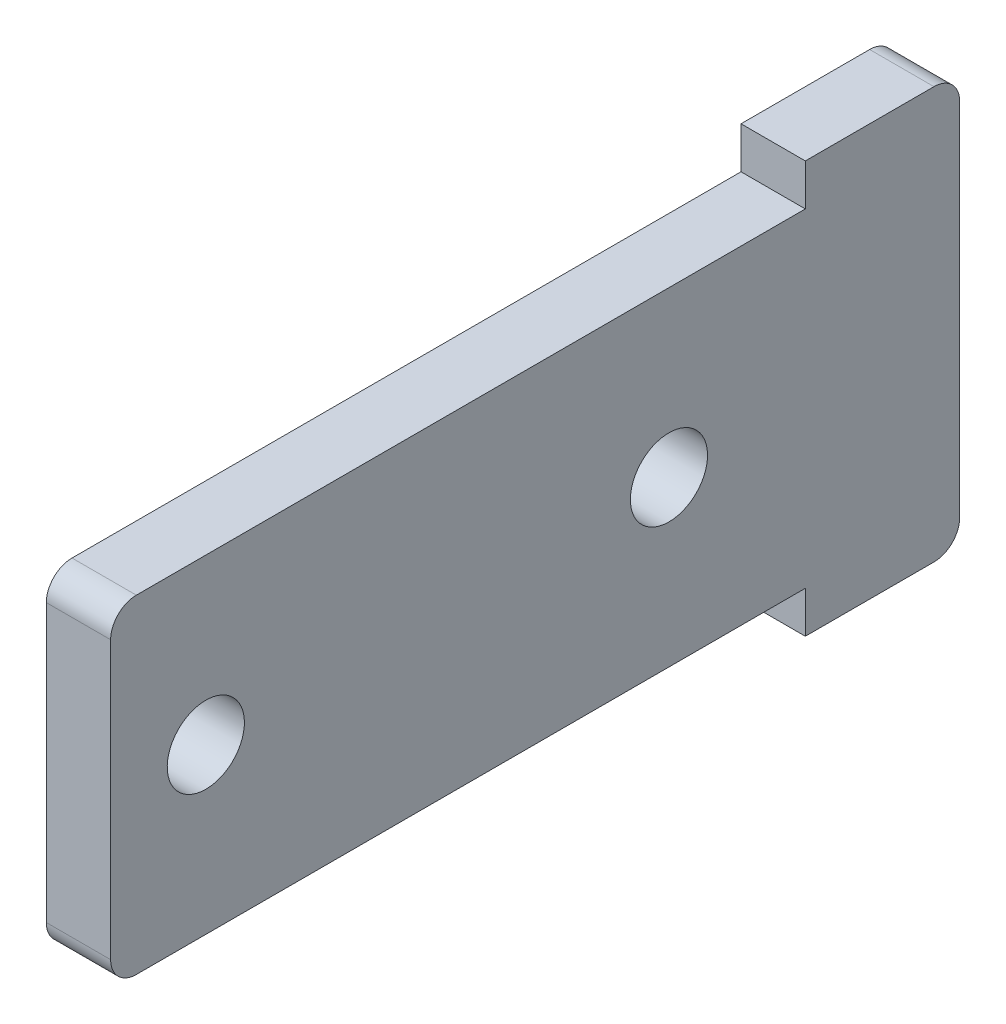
ISO-10303-21;
HEADER;
FILE_DESCRIPTION(('STEP AP214'),'2;1');
FILE_NAME('part.step','',(''),(''),'','','');
FILE_SCHEMA(('AUTOMOTIVE_DESIGN { 1 0 10303 214 1 1 1 1 }'));
ENDSEC;
DATA;
#1=APPLICATION_CONTEXT('core data for automotive mechanical design processes');
#2=APPLICATION_PROTOCOL_DEFINITION('international standard','automotive_design',2000,#1);
#3=PRODUCT_CONTEXT('',#1,'mechanical');
#4=PRODUCT('Part','Part','',(#3));
#5=PRODUCT_RELATED_PRODUCT_CATEGORY('part','',(#4));
#6=PRODUCT_DEFINITION_FORMATION('','',#4);
#7=PRODUCT_DEFINITION_CONTEXT('part definition',#1,'design');
#8=PRODUCT_DEFINITION('design','',#6,#7);
#9=PRODUCT_DEFINITION_SHAPE('','',#8);
#10=(LENGTH_UNIT() NAMED_UNIT(*) SI_UNIT(.MILLI.,.METRE.));
#11=(NAMED_UNIT(*) PLANE_ANGLE_UNIT() SI_UNIT($,.RADIAN.));
#12=(NAMED_UNIT(*) SI_UNIT($,.STERADIAN.) SOLID_ANGLE_UNIT());
#13=UNCERTAINTY_MEASURE_WITH_UNIT(LENGTH_MEASURE(1.E-05),#10,'distance_accuracy_value','');
#14=(GEOMETRIC_REPRESENTATION_CONTEXT(3) GLOBAL_UNCERTAINTY_ASSIGNED_CONTEXT((#13)) GLOBAL_UNIT_ASSIGNED_CONTEXT((#10,
#11,#12)) REPRESENTATION_CONTEXT('',''));
#15=CARTESIAN_POINT('',(0.,0.,0.));
#16=DIRECTION('',(0.,0.,1.));
#17=DIRECTION('',(1.,0.,0.));
#18=AXIS2_PLACEMENT_3D('',#15,#16,#17);
#19=CARTESIAN_POINT('',(-139.654437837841,-38.0629308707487,10.5));
#20=DIRECTION('',(1.,0.,0.));
#21=DIRECTION('',(0.,1.,0.));
#22=AXIS2_PLACEMENT_3D('',#19,#20,#21);
#23=PLANE('',#22);
#24=CARTESIAN_POINT('',(-139.654437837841,-38.0629740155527,23.3));
#25=DIRECTION('',(1.,0.,0.));
#26=DIRECTION('',(0.,1.,0.));
#27=AXIS2_PLACEMENT_3D('',#24,#25,#26);
#28=CIRCLE('',#27,1.5);
#29=CARTESIAN_POINT('',(-139.654437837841,-39.5629740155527,23.3));
#30=VERTEX_POINT('',#29);
#31=EDGE_CURVE('E207',#30,#30,#28,.T.);
#32=ORIENTED_EDGE('',*,*,#31,.T.);
#33=EDGE_LOOP('',(#32));
#34=FACE_BOUND('',#33,.T.);
#35=CARTESIAN_POINT('',(-139.654437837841,-38.0629740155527,5.3));
#36=DIRECTION('',(1.,0.,0.));
#37=DIRECTION('',(0.,1.,0.));
#38=AXIS2_PLACEMENT_3D('',#35,#36,#37);
#39=CIRCLE('',#38,1.5);
#40=CARTESIAN_POINT('',(-139.654437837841,-39.5629740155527,5.3));
#41=VERTEX_POINT('',#40);
#42=EDGE_CURVE('E199',#41,#41,#39,.T.);
#43=ORIENTED_EDGE('',*,*,#42,.T.);
#44=EDGE_LOOP('',(#43));
#45=FACE_BOUND('',#44,.T.);
#46=CARTESIAN_POINT('',(-139.654437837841,-45.0629308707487,-5.));
#47=DIRECTION('',(-1.,0.,0.));
#48=DIRECTION('',(0.,-1.,0.));
#49=AXIS2_PLACEMENT_3D('',#46,#47,#48);
#50=CIRCLE('',#49,1.);
#51=CARTESIAN_POINT('',(-139.654437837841,-45.0629308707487,-6.));
#52=VERTEX_POINT('',#51);
#53=CARTESIAN_POINT('',(-139.654437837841,-46.0629308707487,-5.));
#54=VERTEX_POINT('',#53);
#55=EDGE_CURVE('E11',#52,#54,#50,.T.);
#56=ORIENTED_EDGE('',*,*,#55,.T.);
#57=DIRECTION('',(0.,0.,1.));
#58=VECTOR('',#57,1.);
#59=CARTESIAN_POINT('',(-139.654437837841,-46.0629308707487,-5.));
#60=LINE('',#59,#58);
#61=CARTESIAN_POINT('',(-139.654437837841,-46.0629308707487,0.));
#62=VERTEX_POINT('',#61);
#63=EDGE_CURVE('E171',#54,#62,#60,.T.);
#64=ORIENTED_EDGE('',*,*,#63,.T.);
#65=DIRECTION('',(0.,1.,0.));
#66=VECTOR('',#65,1.);
#67=CARTESIAN_POINT('',(-139.654437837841,-46.0629308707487,0.));
#68=LINE('',#67,#66);
#69=CARTESIAN_POINT('',(-139.654437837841,-44.4468944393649,0.));
#70=VERTEX_POINT('',#69);
#71=EDGE_CURVE('E123',#62,#70,#68,.T.);
#72=ORIENTED_EDGE('',*,*,#71,.T.);
#73=DIRECTION('',(0.,0.,1.));
#74=VECTOR('',#73,1.);
#75=CARTESIAN_POINT('',(-139.654437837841,-44.4468944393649,26.));
#76=LINE('',#75,#74);
#77=CARTESIAN_POINT('',(-139.654437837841,-44.4468944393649,26.));
#78=VERTEX_POINT('',#77);
#79=EDGE_CURVE('E227',#70,#78,#76,.T.);
#80=ORIENTED_EDGE('',*,*,#79,.T.);
#81=CARTESIAN_POINT('',(-139.654437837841,-43.4468944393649,26.));
#82=DIRECTION('',(-1.,0.,0.));
#83=DIRECTION('',(0.,0.,1.));
#84=AXIS2_PLACEMENT_3D('',#81,#82,#83);
#85=CIRCLE('',#84,1.);
#86=CARTESIAN_POINT('',(-139.654437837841,-43.4468944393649,27.));
#87=VERTEX_POINT('',#86);
#88=EDGE_CURVE('E253',#78,#87,#85,.T.);
#89=ORIENTED_EDGE('',*,*,#88,.T.);
#90=DIRECTION('',(0.,1.,0.));
#91=VECTOR('',#90,1.);
#92=CARTESIAN_POINT('',(-139.654437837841,-32.6789673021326,27.));
#93=LINE('',#92,#91);
#94=CARTESIAN_POINT('',(-139.654437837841,-32.6789673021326,27.));
#95=VERTEX_POINT('',#94);
#96=EDGE_CURVE('E219',#87,#95,#93,.T.);
#97=ORIENTED_EDGE('',*,*,#96,.T.);
#98=CARTESIAN_POINT('',(-139.654437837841,-32.6789673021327,26.));
#99=DIRECTION('',(-1.,0.,0.));
#100=DIRECTION('',(0.,1.,0.));
#101=AXIS2_PLACEMENT_3D('',#98,#99,#100);
#102=CIRCLE('',#101,1.);
#103=CARTESIAN_POINT('',(-139.654437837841,-31.6789673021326,26.));
#104=VERTEX_POINT('',#103);
#105=EDGE_CURVE('E153',#95,#104,#102,.T.);
#106=ORIENTED_EDGE('',*,*,#105,.T.);
#107=DIRECTION('',(0.,0.,-1.));
#108=VECTOR('',#107,1.);
#109=CARTESIAN_POINT('',(-139.654437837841,-31.6789673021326,0.));
#110=LINE('',#109,#108);
#111=CARTESIAN_POINT('',(-139.654437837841,-31.6789673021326,0.));
#112=VERTEX_POINT('',#111);
#113=EDGE_CURVE('E231',#104,#112,#110,.T.);
#114=ORIENTED_EDGE('',*,*,#113,.T.);
#115=DIRECTION('',(0.,1.,0.));
#116=VECTOR('',#115,1.);
#117=CARTESIAN_POINT('',(-139.654437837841,-46.0629308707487,0.));
#118=LINE('',#117,#116);
#119=CARTESIAN_POINT('',(-139.654437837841,-30.0629308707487,0.));
#120=VERTEX_POINT('',#119);
#121=EDGE_CURVE('E282',#112,#120,#118,.T.);
#122=ORIENTED_EDGE('',*,*,#121,.T.);
#123=DIRECTION('',(0.,0.,-1.));
#124=VECTOR('',#123,1.);
#125=CARTESIAN_POINT('',(-139.654437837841,-30.0629308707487,0.));
#126=LINE('',#125,#124);
#127=CARTESIAN_POINT('',(-139.654437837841,-30.0629308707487,-5.));
#128=VERTEX_POINT('',#127);
#129=EDGE_CURVE('E93',#120,#128,#126,.T.);
#130=ORIENTED_EDGE('',*,*,#129,.T.);
#131=CARTESIAN_POINT('',(-139.654437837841,-31.0629308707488,-5.));
#132=DIRECTION('',(-1.,0.,0.));
#133=DIRECTION('',(0.,0.,-1.));
#134=AXIS2_PLACEMENT_3D('',#131,#132,#133);
#135=CIRCLE('',#134,1.);
#136=CARTESIAN_POINT('',(-139.654437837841,-31.0629308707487,-6.));
#137=VERTEX_POINT('',#136);
#138=EDGE_CURVE('E218',#128,#137,#135,.T.);
#139=ORIENTED_EDGE('',*,*,#138,.T.);
#140=DIRECTION('',(0.,-1.,0.));
#141=VECTOR('',#140,1.);
#142=CARTESIAN_POINT('',(-139.654437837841,-31.0629308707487,-6.));
#143=LINE('',#142,#141);
#144=EDGE_CURVE('E213',#137,#52,#143,.T.);
#145=ORIENTED_EDGE('',*,*,#144,.T.);
#146=EDGE_LOOP('',(#56,#64,#72,#80,#89,#97,#106,#114,#122,#130,#139,#145));
#147=FACE_BOUND('',#146,.T.);
#148=ADVANCED_FACE('F16',(#34,#45,#147),#23,.F.);
#149=CARTESIAN_POINT('',(-137.154437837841,-38.0629308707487,10.5));
#150=DIRECTION('',(1.,0.,0.));
#151=DIRECTION('',(0.,1.,0.));
#152=AXIS2_PLACEMENT_3D('',#149,#150,#151);
#153=PLANE('',#152);
#154=CARTESIAN_POINT('',(-137.154437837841,-38.0629740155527,23.3));
#155=DIRECTION('',(-1.,0.,0.));
#156=DIRECTION('',(0.,1.,0.));
#157=AXIS2_PLACEMENT_3D('',#154,#155,#156);
#158=CIRCLE('',#157,1.5);
#159=CARTESIAN_POINT('',(-137.154437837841,-39.5629740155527,23.3));
#160=VERTEX_POINT('',#159);
#161=EDGE_CURVE('E204',#160,#160,#158,.T.);
#162=ORIENTED_EDGE('',*,*,#161,.T.);
#163=EDGE_LOOP('',(#162));
#164=FACE_BOUND('',#163,.T.);
#165=CARTESIAN_POINT('',(-137.154437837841,-38.0629740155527,5.3));
#166=DIRECTION('',(-1.,0.,0.));
#167=DIRECTION('',(0.,1.,0.));
#168=AXIS2_PLACEMENT_3D('',#165,#166,#167);
#169=CIRCLE('',#168,1.5);
#170=CARTESIAN_POINT('',(-137.154437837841,-39.5629740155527,5.3));
#171=VERTEX_POINT('',#170);
#172=EDGE_CURVE('E203',#171,#171,#169,.T.);
#173=ORIENTED_EDGE('',*,*,#172,.T.);
#174=EDGE_LOOP('',(#173));
#175=FACE_BOUND('',#174,.T.);
#176=CARTESIAN_POINT('',(-137.154437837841,-45.0629308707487,-5.));
#177=DIRECTION('',(1.,0.,0.));
#178=DIRECTION('',(0.,-1.,0.));
#179=AXIS2_PLACEMENT_3D('',#176,#177,#178);
#180=CIRCLE('',#179,1.);
#181=CARTESIAN_POINT('',(-137.154437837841,-46.0629308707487,-5.));
#182=VERTEX_POINT('',#181);
#183=CARTESIAN_POINT('',(-137.154437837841,-45.0629308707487,-6.));
#184=VERTEX_POINT('',#183);
#185=EDGE_CURVE('E27',#182,#184,#180,.T.);
#186=ORIENTED_EDGE('',*,*,#185,.T.);
#187=DIRECTION('',(0.,-1.,0.));
#188=VECTOR('',#187,1.);
#189=CARTESIAN_POINT('',(-137.154437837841,-31.0629308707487,-6.));
#190=LINE('',#189,#188);
#191=CARTESIAN_POINT('',(-137.154437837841,-31.0629308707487,-6.));
#192=VERTEX_POINT('',#191);
#193=EDGE_CURVE('E202',#192,#184,#190,.T.);
#194=ORIENTED_EDGE('',*,*,#193,.F.);
#195=CARTESIAN_POINT('',(-137.154437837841,-31.0629308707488,-5.));
#196=DIRECTION('',(1.,0.,0.));
#197=DIRECTION('',(0.,0.,-1.));
#198=AXIS2_PLACEMENT_3D('',#195,#196,#197);
#199=CIRCLE('',#198,1.);
#200=CARTESIAN_POINT('',(-137.154437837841,-30.0629308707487,-5.));
#201=VERTEX_POINT('',#200);
#202=EDGE_CURVE('E212',#192,#201,#199,.T.);
#203=ORIENTED_EDGE('',*,*,#202,.T.);
#204=DIRECTION('',(0.,0.,-1.));
#205=VECTOR('',#204,1.);
#206=CARTESIAN_POINT('',(-137.154437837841,-30.0629308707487,0.));
#207=LINE('',#206,#205);
#208=CARTESIAN_POINT('',(-137.154437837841,-30.0629308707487,0.));
#209=VERTEX_POINT('',#208);
#210=EDGE_CURVE('E217',#209,#201,#207,.T.);
#211=ORIENTED_EDGE('',*,*,#210,.F.);
#212=DIRECTION('',(0.,1.,0.));
#213=VECTOR('',#212,1.);
#214=CARTESIAN_POINT('',(-137.154437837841,-46.0629308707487,0.));
#215=LINE('',#214,#213);
#216=CARTESIAN_POINT('',(-137.154437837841,-31.6789673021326,0.));
#217=VERTEX_POINT('',#216);
#218=EDGE_CURVE('E80',#217,#209,#215,.T.);
#219=ORIENTED_EDGE('',*,*,#218,.F.);
#220=DIRECTION('',(0.,0.,1.));
#221=VECTOR('',#220,1.);
#222=CARTESIAN_POINT('',(-137.154437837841,-31.6789673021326,0.));
#223=LINE('',#222,#221);
#224=CARTESIAN_POINT('',(-137.154437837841,-31.6789673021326,26.));
#225=VERTEX_POINT('',#224);
#226=EDGE_CURVE('E270',#217,#225,#223,.T.);
#227=ORIENTED_EDGE('',*,*,#226,.T.);
#228=CARTESIAN_POINT('',(-137.154437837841,-32.6789673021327,26.));
#229=DIRECTION('',(1.,0.,0.));
#230=DIRECTION('',(0.,1.,0.));
#231=AXIS2_PLACEMENT_3D('',#228,#229,#230);
#232=CIRCLE('',#231,1.);
#233=CARTESIAN_POINT('',(-137.154437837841,-32.6789673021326,27.));
#234=VERTEX_POINT('',#233);
#235=EDGE_CURVE('E164',#225,#234,#232,.T.);
#236=ORIENTED_EDGE('',*,*,#235,.T.);
#237=DIRECTION('',(0.,-1.,0.));
#238=VECTOR('',#237,1.);
#239=CARTESIAN_POINT('',(-137.154437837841,-32.6789673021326,27.));
#240=LINE('',#239,#238);
#241=CARTESIAN_POINT('',(-137.154437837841,-43.4468944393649,27.));
#242=VERTEX_POINT('',#241);
#243=EDGE_CURVE('E196',#234,#242,#240,.T.);
#244=ORIENTED_EDGE('',*,*,#243,.T.);
#245=CARTESIAN_POINT('',(-137.154437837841,-43.4468944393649,26.));
#246=DIRECTION('',(1.,0.,0.));
#247=DIRECTION('',(0.,0.,1.));
#248=AXIS2_PLACEMENT_3D('',#245,#246,#247);
#249=CIRCLE('',#248,1.);
#250=CARTESIAN_POINT('',(-137.154437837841,-44.4468944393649,26.));
#251=VERTEX_POINT('',#250);
#252=EDGE_CURVE('E291',#242,#251,#249,.T.);
#253=ORIENTED_EDGE('',*,*,#252,.T.);
#254=DIRECTION('',(0.,0.,-1.));
#255=VECTOR('',#254,1.);
#256=CARTESIAN_POINT('',(-137.154437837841,-44.4468944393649,26.));
#257=LINE('',#256,#255);
#258=CARTESIAN_POINT('',(-137.154437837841,-44.4468944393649,0.));
#259=VERTEX_POINT('',#258);
#260=EDGE_CURVE('E223',#251,#259,#257,.T.);
#261=ORIENTED_EDGE('',*,*,#260,.T.);
#262=DIRECTION('',(0.,1.,0.));
#263=VECTOR('',#262,1.);
#264=CARTESIAN_POINT('',(-137.154437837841,-46.0629308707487,0.));
#265=LINE('',#264,#263);
#266=CARTESIAN_POINT('',(-137.154437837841,-46.0629308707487,0.));
#267=VERTEX_POINT('',#266);
#268=EDGE_CURVE('E138',#267,#259,#265,.T.);
#269=ORIENTED_EDGE('',*,*,#268,.F.);
#270=DIRECTION('',(0.,0.,1.));
#271=VECTOR('',#270,1.);
#272=CARTESIAN_POINT('',(-137.154437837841,-46.0629308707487,-5.));
#273=LINE('',#272,#271);
#274=EDGE_CURVE('E177',#182,#267,#273,.T.);
#275=ORIENTED_EDGE('',*,*,#274,.F.);
#276=EDGE_LOOP('',(#186,#194,#203,#211,#219,#227,#236,#244,#253,#261,#269,#275));
#277=FACE_BOUND('',#276,.T.);
#278=ADVANCED_FACE('F322',(#164,#175,#277),#153,.T.);
#279=CARTESIAN_POINT('',(-137.154437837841,-45.0629308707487,-5.));
#280=DIRECTION('',(-1.,0.,0.));
#281=DIRECTION('',(0.,-1.,0.));
#282=AXIS2_PLACEMENT_3D('',#279,#280,#281);
#283=CYLINDRICAL_SURFACE('',#282,1.);
#284=ORIENTED_EDGE('',*,*,#185,.F.);
#285=DIRECTION('',(-1.,0.,0.));
#286=VECTOR('',#285,1.);
#287=CARTESIAN_POINT('',(-137.154437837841,-46.0629308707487,-5.));
#288=LINE('',#287,#286);
#289=EDGE_CURVE('E176',#182,#54,#288,.T.);
#290=ORIENTED_EDGE('',*,*,#289,.T.);
#291=ORIENTED_EDGE('',*,*,#55,.F.);
#292=DIRECTION('',(-1.,0.,0.));
#293=VECTOR('',#292,1.);
#294=CARTESIAN_POINT('',(-137.154437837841,-45.0629308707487,-6.));
#295=LINE('',#294,#293);
#296=EDGE_CURVE('E238',#184,#52,#295,.T.);
#297=ORIENTED_EDGE('',*,*,#296,.F.);
#298=EDGE_LOOP('',(#284,#290,#291,#297));
#299=FACE_BOUND('',#298,.T.);
#300=ADVANCED_FACE('F324',(#299),#283,.T.);
#301=CARTESIAN_POINT('',(-137.154437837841,-46.0629308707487,-5.));
#302=DIRECTION('',(0.,-1.,0.));
#303=DIRECTION('',(0.,0.,-1.));
#304=AXIS2_PLACEMENT_3D('',#301,#302,#303);
#305=PLANE('',#304);
#306=ORIENTED_EDGE('',*,*,#274,.T.);
#307=DIRECTION('',(-1.,0.,0.));
#308=VECTOR('',#307,1.);
#309=CARTESIAN_POINT('',(-137.154437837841,-46.0629308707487,0.));
#310=LINE('',#309,#308);
#311=EDGE_CURVE('E179',#267,#62,#310,.T.);
#312=ORIENTED_EDGE('',*,*,#311,.T.);
#313=ORIENTED_EDGE('',*,*,#63,.F.);
#314=ORIENTED_EDGE('',*,*,#289,.F.);
#315=EDGE_LOOP('',(#306,#312,#313,#314));
#316=FACE_BOUND('',#315,.T.);
#317=ADVANCED_FACE('F180',(#316),#305,.T.);
#318=CARTESIAN_POINT('',(-137.154437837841,-46.0629308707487,0.));
#319=DIRECTION('',(0.,0.,1.));
#320=DIRECTION('',(1.,0.,0.));
#321=AXIS2_PLACEMENT_3D('',#318,#319,#320);
#322=PLANE('',#321);
#323=ORIENTED_EDGE('',*,*,#268,.T.);
#324=DIRECTION('',(-1.,0.,0.));
#325=VECTOR('',#324,1.);
#326=CARTESIAN_POINT('',(-137.154437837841,-44.4468944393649,0.));
#327=LINE('',#326,#325);
#328=EDGE_CURVE('E185',#259,#70,#327,.T.);
#329=ORIENTED_EDGE('',*,*,#328,.T.);
#330=ORIENTED_EDGE('',*,*,#71,.F.);
#331=ORIENTED_EDGE('',*,*,#311,.F.);
#332=EDGE_LOOP('',(#323,#329,#330,#331));
#333=FACE_BOUND('',#332,.T.);
#334=ADVANCED_FACE('F184',(#333),#322,.T.);
#335=CARTESIAN_POINT('',(-137.154437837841,-44.4468944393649,0.));
#336=DIRECTION('',(0.,-1.,0.));
#337=DIRECTION('',(0.,0.,-1.));
#338=AXIS2_PLACEMENT_3D('',#335,#336,#337);
#339=PLANE('',#338);
#340=ORIENTED_EDGE('',*,*,#260,.F.);
#341=DIRECTION('',(-1.,0.,0.));
#342=VECTOR('',#341,1.);
#343=CARTESIAN_POINT('',(-137.154437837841,-44.4468944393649,26.));
#344=LINE('',#343,#342);
#345=EDGE_CURVE('E228',#251,#78,#344,.T.);
#346=ORIENTED_EDGE('',*,*,#345,.T.);
#347=ORIENTED_EDGE('',*,*,#79,.F.);
#348=ORIENTED_EDGE('',*,*,#328,.F.);
#349=EDGE_LOOP('',(#340,#346,#347,#348));
#350=FACE_BOUND('',#349,.T.);
#351=ADVANCED_FACE('F361',(#350),#339,.T.);
#352=CARTESIAN_POINT('',(-137.154437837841,-43.4468944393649,26.));
#353=DIRECTION('',(-1.,0.,0.));
#354=DIRECTION('',(0.,0.,1.));
#355=AXIS2_PLACEMENT_3D('',#352,#353,#354);
#356=CYLINDRICAL_SURFACE('',#355,1.);
#357=ORIENTED_EDGE('',*,*,#252,.F.);
#358=DIRECTION('',(-1.,0.,0.));
#359=VECTOR('',#358,1.);
#360=CARTESIAN_POINT('',(-137.154437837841,-43.4468944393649,27.));
#361=LINE('',#360,#359);
#362=EDGE_CURVE('E222',#242,#87,#361,.T.);
#363=ORIENTED_EDGE('',*,*,#362,.T.);
#364=ORIENTED_EDGE('',*,*,#88,.F.);
#365=ORIENTED_EDGE('',*,*,#345,.F.);
#366=EDGE_LOOP('',(#357,#363,#364,#365));
#367=FACE_BOUND('',#366,.T.);
#368=ADVANCED_FACE('F349',(#367),#356,.T.);
#369=CARTESIAN_POINT('',(-137.154437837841,-43.4468944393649,27.));
#370=DIRECTION('',(0.,0.,1.));
#371=DIRECTION('',(1.,0.,0.));
#372=AXIS2_PLACEMENT_3D('',#369,#370,#371);
#373=PLANE('',#372);
#374=ORIENTED_EDGE('',*,*,#243,.F.);
#375=DIRECTION('',(-1.,0.,0.));
#376=VECTOR('',#375,1.);
#377=CARTESIAN_POINT('',(-137.154437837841,-32.6789673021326,27.));
#378=LINE('',#377,#376);
#379=EDGE_CURVE('E292',#234,#95,#378,.T.);
#380=ORIENTED_EDGE('',*,*,#379,.T.);
#381=ORIENTED_EDGE('',*,*,#96,.F.);
#382=ORIENTED_EDGE('',*,*,#362,.F.);
#383=EDGE_LOOP('',(#374,#380,#381,#382));
#384=FACE_BOUND('',#383,.T.);
#385=ADVANCED_FACE('F350',(#384),#373,.T.);
#386=CARTESIAN_POINT('',(-137.154437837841,-32.6789673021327,26.));
#387=DIRECTION('',(-1.,0.,0.));
#388=DIRECTION('',(0.,1.,0.));
#389=AXIS2_PLACEMENT_3D('',#386,#387,#388);
#390=CYLINDRICAL_SURFACE('',#389,1.);
#391=ORIENTED_EDGE('',*,*,#235,.F.);
#392=DIRECTION('',(-1.,0.,0.));
#393=VECTOR('',#392,1.);
#394=CARTESIAN_POINT('',(-137.154437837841,-31.6789673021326,26.));
#395=LINE('',#394,#393);
#396=EDGE_CURVE('E198',#225,#104,#395,.T.);
#397=ORIENTED_EDGE('',*,*,#396,.T.);
#398=ORIENTED_EDGE('',*,*,#105,.F.);
#399=ORIENTED_EDGE('',*,*,#379,.F.);
#400=EDGE_LOOP('',(#391,#397,#398,#399));
#401=FACE_BOUND('',#400,.T.);
#402=ADVANCED_FACE('F352',(#401),#390,.T.);
#403=CARTESIAN_POINT('',(-137.154437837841,-31.6789673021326,26.));
#404=DIRECTION('',(0.,1.,0.));
#405=DIRECTION('',(1.,0.,0.));
#406=AXIS2_PLACEMENT_3D('',#403,#404,#405);
#407=PLANE('',#406);
#408=ORIENTED_EDGE('',*,*,#226,.F.);
#409=DIRECTION('',(-1.,0.,0.));
#410=VECTOR('',#409,1.);
#411=CARTESIAN_POINT('',(-137.154437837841,-31.6789673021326,0.));
#412=LINE('',#411,#410);
#413=EDGE_CURVE('E20',#217,#112,#412,.T.);
#414=ORIENTED_EDGE('',*,*,#413,.T.);
#415=ORIENTED_EDGE('',*,*,#113,.F.);
#416=ORIENTED_EDGE('',*,*,#396,.F.);
#417=EDGE_LOOP('',(#408,#414,#415,#416));
#418=FACE_BOUND('',#417,.T.);
#419=ADVANCED_FACE('F359',(#418),#407,.T.);
#420=CARTESIAN_POINT('',(-137.154437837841,-31.6789673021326,0.));
#421=DIRECTION('',(0.,0.,1.));
#422=DIRECTION('',(1.,0.,0.));
#423=AXIS2_PLACEMENT_3D('',#420,#421,#422);
#424=PLANE('',#423);
#425=ORIENTED_EDGE('',*,*,#218,.T.);
#426=DIRECTION('',(-1.,0.,0.));
#427=VECTOR('',#426,1.);
#428=CARTESIAN_POINT('',(-137.154437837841,-30.0629308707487,0.));
#429=LINE('',#428,#427);
#430=EDGE_CURVE('E247',#209,#120,#429,.T.);
#431=ORIENTED_EDGE('',*,*,#430,.T.);
#432=ORIENTED_EDGE('',*,*,#121,.F.);
#433=ORIENTED_EDGE('',*,*,#413,.F.);
#434=EDGE_LOOP('',(#425,#431,#432,#433));
#435=FACE_BOUND('',#434,.T.);
#436=ADVANCED_FACE('F372',(#435),#424,.T.);
#437=CARTESIAN_POINT('',(-137.154437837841,-30.0629308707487,0.));
#438=DIRECTION('',(0.,1.,0.));
#439=DIRECTION('',(1.,0.,0.));
#440=AXIS2_PLACEMENT_3D('',#437,#438,#439);
#441=PLANE('',#440);
#442=ORIENTED_EDGE('',*,*,#210,.T.);
#443=DIRECTION('',(-1.,0.,0.));
#444=VECTOR('',#443,1.);
#445=CARTESIAN_POINT('',(-137.154437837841,-30.0629308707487,-5.));
#446=LINE('',#445,#444);
#447=EDGE_CURVE('E214',#201,#128,#446,.T.);
#448=ORIENTED_EDGE('',*,*,#447,.T.);
#449=ORIENTED_EDGE('',*,*,#129,.F.);
#450=ORIENTED_EDGE('',*,*,#430,.F.);
#451=EDGE_LOOP('',(#442,#448,#449,#450));
#452=FACE_BOUND('',#451,.T.);
#453=ADVANCED_FACE('F370',(#452),#441,.T.);
#454=CARTESIAN_POINT('',(-137.154437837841,-31.0629308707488,-5.));
#455=DIRECTION('',(-1.,0.,0.));
#456=DIRECTION('',(0.,0.,-1.));
#457=AXIS2_PLACEMENT_3D('',#454,#455,#456);
#458=CYLINDRICAL_SURFACE('',#457,1.);
#459=ORIENTED_EDGE('',*,*,#202,.F.);
#460=DIRECTION('',(-1.,0.,0.));
#461=VECTOR('',#460,1.);
#462=CARTESIAN_POINT('',(-137.154437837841,-31.0629308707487,-6.));
#463=LINE('',#462,#461);
#464=EDGE_CURVE('E208',#192,#137,#463,.T.);
#465=ORIENTED_EDGE('',*,*,#464,.T.);
#466=ORIENTED_EDGE('',*,*,#138,.F.);
#467=ORIENTED_EDGE('',*,*,#447,.F.);
#468=EDGE_LOOP('',(#459,#465,#466,#467));
#469=FACE_BOUND('',#468,.T.);
#470=ADVANCED_FACE('F334',(#469),#458,.T.);
#471=CARTESIAN_POINT('',(-137.154437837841,-31.0629308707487,-6.));
#472=DIRECTION('',(0.,0.,-1.));
#473=DIRECTION('',(-1.,0.,0.));
#474=AXIS2_PLACEMENT_3D('',#471,#472,#473);
#475=PLANE('',#474);
#476=ORIENTED_EDGE('',*,*,#193,.T.);
#477=ORIENTED_EDGE('',*,*,#296,.T.);
#478=ORIENTED_EDGE('',*,*,#144,.F.);
#479=ORIENTED_EDGE('',*,*,#464,.F.);
#480=EDGE_LOOP('',(#476,#477,#478,#479));
#481=FACE_BOUND('',#480,.T.);
#482=ADVANCED_FACE('F18',(#481),#475,.T.);
#483=CARTESIAN_POINT('',(-137.154437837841,-38.0629740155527,5.3));
#484=DIRECTION('',(-1.,0.,0.));
#485=DIRECTION('',(0.,1.,0.));
#486=AXIS2_PLACEMENT_3D('',#483,#484,#485);
#487=CYLINDRICAL_SURFACE('',#486,1.5);
#488=ORIENTED_EDGE('',*,*,#42,.F.);
#489=EDGE_LOOP('',(#488));
#490=FACE_BOUND('',#489,.T.);
#491=ORIENTED_EDGE('',*,*,#172,.F.);
#492=EDGE_LOOP('',(#491));
#493=FACE_BOUND('',#492,.T.);
#494=ADVANCED_FACE('F318',(#490,#493),#487,.F.);
#495=CARTESIAN_POINT('',(-137.154437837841,-38.0629740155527,23.3));
#496=DIRECTION('',(-1.,0.,0.));
#497=DIRECTION('',(0.,1.,0.));
#498=AXIS2_PLACEMENT_3D('',#495,#496,#497);
#499=CYLINDRICAL_SURFACE('',#498,1.5);
#500=ORIENTED_EDGE('',*,*,#31,.F.);
#501=EDGE_LOOP('',(#500));
#502=FACE_BOUND('',#501,.T.);
#503=ORIENTED_EDGE('',*,*,#161,.F.);
#504=EDGE_LOOP('',(#503));
#505=FACE_BOUND('',#504,.T.);
#506=ADVANCED_FACE('F315',(#502,#505),#499,.F.);
#507=CLOSED_SHELL('',(#148,#278,#300,#317,#334,#351,#368,#385,#402,#419,#436,#453,#470,#482,
#494,#506));
#508=MANIFOLD_SOLID_BREP('B1',#507);
#509=ADVANCED_BREP_SHAPE_REPRESENTATION('',(#18,#508),#14);
#510=SHAPE_DEFINITION_REPRESENTATION(#9,#509);
ENDSEC;
END-ISO-10303-21;
